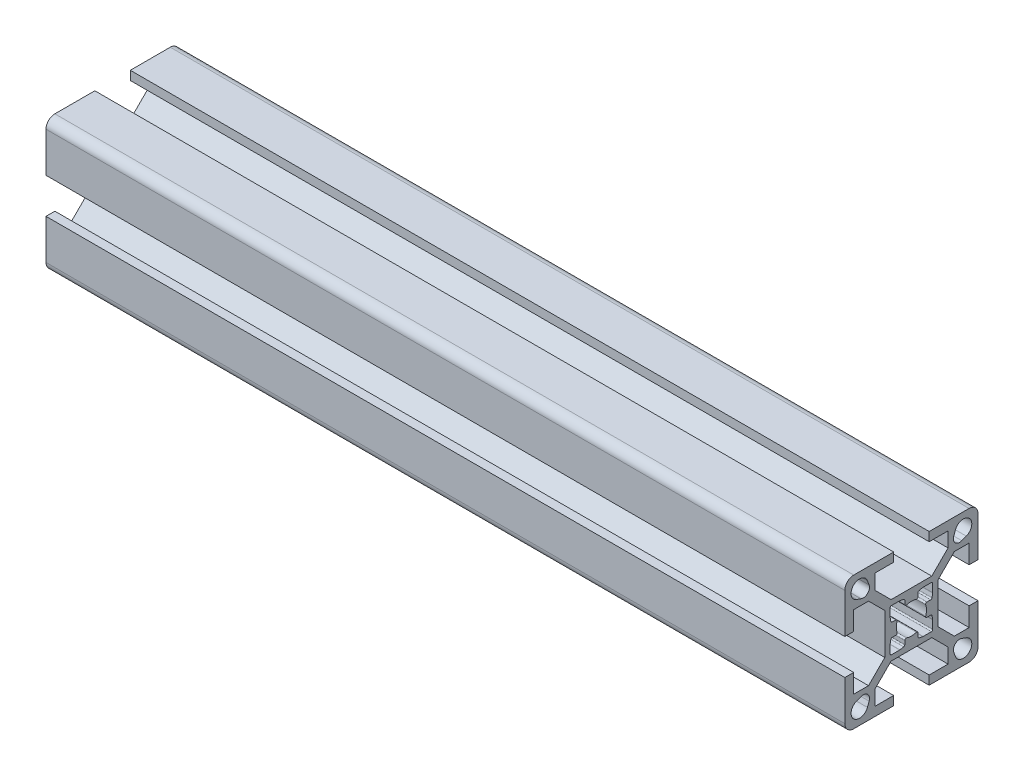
from build123d import *

# Parameters (mm, degrees)
BOSS_EXTRUDE1_DEPTH = 180


with BuildPart() as part:
    # Sketch1 → Boss-Extrude1 (new body)
    with BuildSketch(Plane(origin=(0, 0, 0), x_dir=(0, 0, -1), z_dir=(1, 0, 0))):
        with BuildLine():
            Line((-15, 13), (-15, 4))
            Line((-15, 4), (-13, 4))
            Line((-13, 4), (-13, 8.25))
            Line((-13, 8.25), (-9.664213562, 8.25))
            Line((-9.664213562, 8.25), (-6, 4.585786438))
            Line((-6, 4.585786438), (-6, -4.585786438))
            Line((-6, -4.585786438), (-9.664213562, -8.25))
            Line((-9.664213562, -8.25), (-13, -8.25))
            Line((-13, -8.25), (-13, -4))
            Line((-13, -4), (-15, -4))
            Line((-15, -4), (-15, -13))
            ThreePointArc((-15, -13), (-14.414213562, -14.414213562), (-13, -15))
            Line((-13, -15), (-4, -15))
            Line((-4, -15), (-4, -13))
            Line((-4, -13), (-8.25, -13))
            Line((-8.25, -13), (-8.25, -9.664213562))
            Line((-8.25, -9.664213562), (-4.585786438, -6))
            Line((-4.585786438, -6), (4.585786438, -6))
            Line((4.585786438, -6), (8.25, -9.664213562))
            Line((8.25, -9.664213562), (8.25, -13))
            Line((8.25, -13), (4, -13))
            Line((4, -13), (4, -15))
            Line((4, -15), (13, -15))
            ThreePointArc((13, -15), (14.414213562, -14.414213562), (15, -13))
            Line((15, -13), (15, -4))
            Line((15, -4), (13, -4))
            Line((13, -4), (13, -8.25))
            Line((13, -8.25), (9.664213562, -8.25))
            Line((9.664213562, -8.25), (6, -4.585786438))
            Line((6, -4.585786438), (6, 4.585786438))
            Line((6, 4.585786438), (9.664213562, 8.25))
            Line((9.664213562, 8.25), (13, 8.25))
            Line((13, 8.25), (13, 4))
            Line((13, 4), (15, 4))
            Line((15, 4), (15, 13))
            ThreePointArc((15, 13), (14.414213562, 14.414213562), (13, 15))
            Line((13, 15), (4, 15))
            Line((4, 15), (4, 13))
            Line((4, 13), (8.25, 13))
            Line((8.25, 13), (8.25, 9.664213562))
            Line((8.25, 9.664213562), (4.585786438, 6))
            Line((4.585786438, 6), (-4.585786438, 6))
            Line((-4.585786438, 6), (-8.25, 9.664213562))
            Line((-8.25, 9.664213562), (-8.25, 13))
            Line((-8.25, 13), (-4, 13))
            Line((-4, 13), (-4, 15))
            Line((-4, 15), (-13, 15))
            ThreePointArc((-13, 15), (-14.414213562, 14.414213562), (-15, 13))
        make_face()
        with BuildLine():
            Line((-9.539070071, 11.338915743), (-9.918883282, 12.361530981))
            ThreePointArc((-9.918883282, 12.361530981), (-13.043502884, 13.043502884), (-12.361530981, 9.918883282))
            Line((-12.361530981, 9.918883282), (-11.338915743, 9.539070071))
            ThreePointArc((-11.338915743, 9.539070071), (-9.861522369, 9.861522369), (-9.539070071, 11.338915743))
        make_face(mode=Mode.SUBTRACT)
        with BuildLine():
            Line((9.918883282, 12.361530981), (9.539070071, 11.338915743))
            ThreePointArc((9.539070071, 11.338915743), (9.861522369, 9.861522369), (11.338915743, 9.539070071))
            Line((11.338915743, 9.539070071), (12.361530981, 9.918883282))
            ThreePointArc((12.361530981, 9.918883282), (13.043502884, 13.043502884), (9.918883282, 12.361530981))
        make_face(mode=Mode.SUBTRACT)
        with BuildLine():
            Line((12.361530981, -9.918883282), (11.338915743, -9.539070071))
            ThreePointArc((11.338915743, -9.539070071), (9.861522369, -9.861522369), (9.539070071, -11.338915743))
            Line((9.539070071, -11.338915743), (9.918883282, -12.361530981))
            ThreePointArc((9.918883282, -12.361530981), (13.043502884, -13.043502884), (12.361530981, -9.918883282))
        make_face(mode=Mode.SUBTRACT)
        with BuildLine():
            Line((-11.338915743, -9.539070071), (-12.361530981, -9.918883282))
            ThreePointArc((-12.361530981, -9.918883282), (-13.043502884, -13.043502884), (-9.918883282, -12.361530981))
            Line((-9.918883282, -12.361530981), (-9.539070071, -11.338915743))
            ThreePointArc((-9.539070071, -11.338915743), (-9.861522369, -9.861522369), (-11.338915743, -9.539070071))
        make_face(mode=Mode.SUBTRACT)
        with BuildLine():
            Line((-4.8, -2.644433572), (-4.8, -4.5))
            ThreePointArc((-4.8, -4.5), (-4.712132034, -4.712132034), (-4.5, -4.8))
            Line((-4.5, -4.8), (-2.644433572, -4.8))
            ThreePointArc((-2.644433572, -4.8), (-2.615679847, -4.79861886), (-2.587190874, -4.794488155))
            Line((-2.587190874, -4.794488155), (-1.742757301, -4.630346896))
            ThreePointArc((-1.742757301, -4.630346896), (-1.568512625, -4.526682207), (-1.5, -4.335858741))
            Line((-1.5, -4.335858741), (-1.5, -3.5))
            ThreePointArc((-1.5, -3.5), (-1.374371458, -3.255879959), (-1.102702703, -3.216216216))
            ThreePointArc((-1.102702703, -3.216216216), (0, -3.4), (1.102702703, -3.216216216))
            ThreePointArc((1.102702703, -3.216216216), (1.374371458, -3.255879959), (1.5, -3.5))
            Line((1.5, -3.5), (1.5, -4.335858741))
            ThreePointArc((1.5, -4.335858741), (1.568512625, -4.526682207), (1.742757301, -4.630346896))
            Line((1.742757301, -4.630346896), (2.587190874, -4.794488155))
            ThreePointArc((2.587190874, -4.794488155), (2.615679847, -4.79861886), (2.644433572, -4.8))
            Line((2.644433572, -4.8), (4.5, -4.8))
            ThreePointArc((4.5, -4.8), (4.712132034, -4.712132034), (4.8, -4.5))
            Line((4.8, -4.5), (4.8, -2.644433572))
            ThreePointArc((4.8, -2.644433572), (4.79861886, -2.615679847), (4.794488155, -2.587190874))
            Line((4.794488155, -2.587190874), (4.630346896, -1.742757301))
            ThreePointArc((4.630346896, -1.742757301), (4.526682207, -1.568512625), (4.335858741, -1.5))
            Line((4.335858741, -1.5), (3.5, -1.5))
            ThreePointArc((3.5, -1.5), (3.255879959, -1.374371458), (3.216216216, -1.102702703))
            ThreePointArc((3.216216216, -1.102702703), (3.4, 0), (3.216216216, 1.102702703))
            ThreePointArc((3.216216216, 1.102702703), (3.255879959, 1.374371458), (3.5, 1.5))
            Line((3.5, 1.5), (4.335858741, 1.5))
            ThreePointArc((4.335858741, 1.5), (4.526682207, 1.568512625), (4.630346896, 1.742757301))
            Line((4.630346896, 1.742757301), (4.794488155, 2.587190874))
            ThreePointArc((4.794488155, 2.587190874), (4.79861886, 2.615679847), (4.8, 2.644433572))
            Line((4.8, 2.644433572), (4.8, 4.5))
            ThreePointArc((4.8, 4.5), (4.712132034, 4.712132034), (4.5, 4.8))
            Line((4.5, 4.8), (2.644433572, 4.8))
            ThreePointArc((2.644433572, 4.8), (2.615679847, 4.79861886), (2.587190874, 4.794488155))
            Line((2.587190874, 4.794488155), (1.742757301, 4.630346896))
            ThreePointArc((1.742757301, 4.630346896), (1.568512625, 4.526682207), (1.5, 4.335858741))
            Line((1.5, 4.335858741), (1.5, 3.5))
            ThreePointArc((1.5, 3.5), (1.374371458, 3.255879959), (1.102702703, 3.216216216))
            ThreePointArc((1.102702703, 3.216216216), (0, 3.4), (-1.102702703, 3.216216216))
            ThreePointArc((-1.102702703, 3.216216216), (-1.374371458, 3.255879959), (-1.5, 3.5))
            Line((-1.5, 3.5), (-1.5, 4.335858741))
            ThreePointArc((-1.5, 4.335858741), (-1.568512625, 4.526682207), (-1.742757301, 4.630346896))
            Line((-1.742757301, 4.630346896), (-2.587190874, 4.794488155))
            ThreePointArc((-2.587190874, 4.794488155), (-2.615679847, 4.79861886), (-2.644433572, 4.8))
            Line((-2.644433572, 4.8), (-4.5, 4.8))
            ThreePointArc((-4.5, 4.8), (-4.712132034, 4.712132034), (-4.8, 4.5))
            Line((-4.8, 4.5), (-4.8, 2.644433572))
            ThreePointArc((-4.8, 2.644433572), (-4.79861886, 2.615679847), (-4.794488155, 2.587190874))
            Line((-4.794488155, 2.587190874), (-4.630346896, 1.742757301))
            ThreePointArc((-4.630346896, 1.742757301), (-4.526682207, 1.568512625), (-4.335858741, 1.5))
            Line((-4.335858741, 1.5), (-3.5, 1.5))
            ThreePointArc((-3.5, 1.5), (-3.255879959, 1.374371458), (-3.216216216, 1.102702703))
            ThreePointArc((-3.216216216, 1.102702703), (-3.4, 0), (-3.216216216, -1.102702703))
            ThreePointArc((-3.216216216, -1.102702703), (-3.255879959, -1.374371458), (-3.5, -1.5))
            Line((-3.5, -1.5), (-4.335858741, -1.5))
            ThreePointArc((-4.335858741, -1.5), (-4.526682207, -1.568512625), (-4.630346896, -1.742757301))
            Line((-4.630346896, -1.742757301), (-4.794488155, -2.587190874))
            ThreePointArc((-4.794488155, -2.587190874), (-4.79861886, -2.615679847), (-4.8, -2.644433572))
        make_face(mode=Mode.SUBTRACT)
    extrude(amount=BOSS_EXTRUDE1_DEPTH)


solid = part.part
